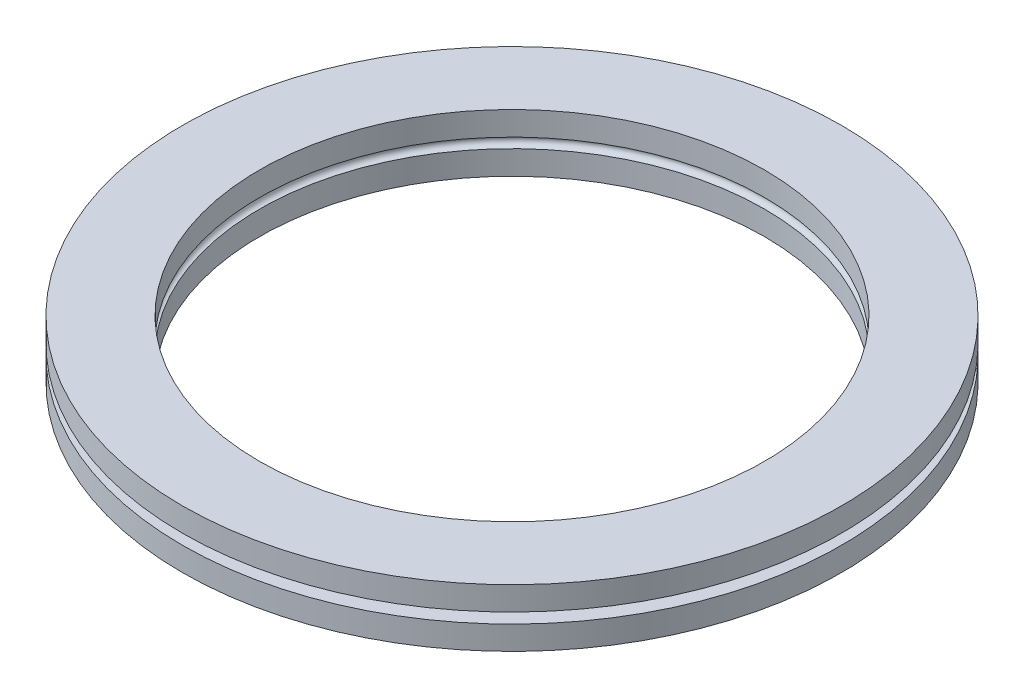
from build123d import *

# Parameters (mm, degrees)
SKETCH2_R          = 1.651
CUT_EXTRUDE1_DEPTH = 155.380763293


with BuildPart() as part:
    # Sketch1 → Base-Revolve (revolve)
    with BuildSketch(Plane.XY, mode=Mode.PRIVATE) as base_revolve_sk:
        with BuildLine():
            Line((83.185, 15.875), (83.185, 8.001))
            ThreePointArc((83.185, 8.001), (84.836, 6.35), (83.185, 4.699))
            Line((83.185, 4.699), (83.185, -3.175))
            Line((83.185, -3.175), (108.585, -3.175))
            Line((108.585, -3.175), (108.585, 4.6355))
            Line((108.585, 4.6355), (95.885, 4.6355))
            Line((95.885, 4.6355), (95.885, 8.0645))
            Line((95.885, 8.0645), (108.585, 8.0645))
            Line((108.585, 8.0645), (108.585, 15.875))
            Line((108.585, 15.875), (83.185, 15.875))
        make_face()
    revolve(base_revolve_sk.sketch.rotate(Axis((0, -8.701474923, 0), (0, 1, 0)), 90), axis=Axis((0, -8.701474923, 0), (0, 1, 0)))

    # Sketch2 → Cut-Extrude1 (cut, through all)
    with BuildSketch(Plane.XY):
        with Locations((83.7565, 6.35)):
            Circle(SKETCH2_R)
    extrude(amount=-CUT_EXTRUDE1_DEPTH, mode=Mode.SUBTRACT)


solid = part.part
